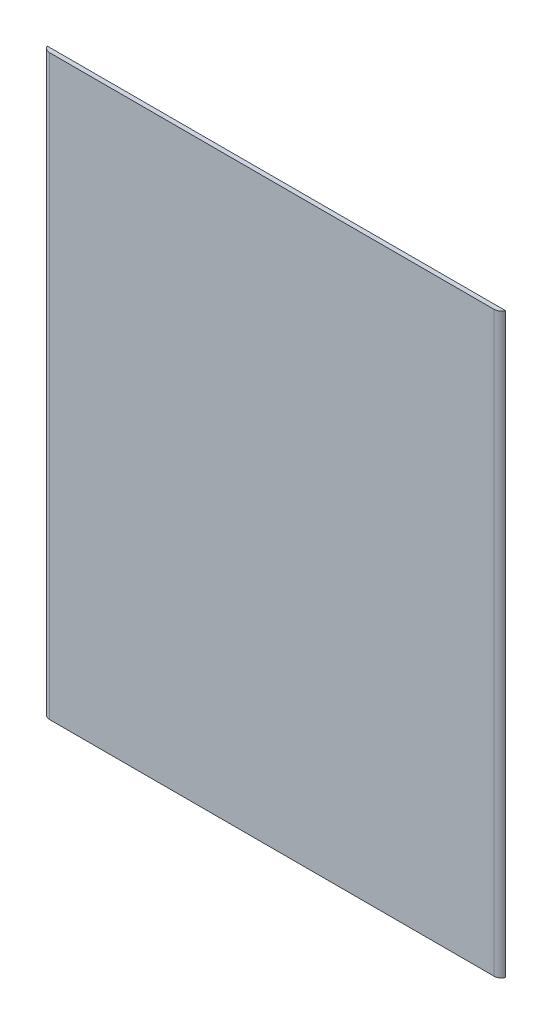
ISO-10303-21;
HEADER;
FILE_DESCRIPTION(('STEP AP214'),'2;1');
FILE_NAME('part.step','',(''),(''),'','','');
FILE_SCHEMA(('AUTOMOTIVE_DESIGN { 1 0 10303 214 1 1 1 1 }'));
ENDSEC;
DATA;
#1=APPLICATION_CONTEXT('core data for automotive mechanical design processes');
#2=APPLICATION_PROTOCOL_DEFINITION('international standard','automotive_design',2000,#1);
#3=PRODUCT_CONTEXT('',#1,'mechanical');
#4=PRODUCT('Part','Part','',(#3));
#5=PRODUCT_RELATED_PRODUCT_CATEGORY('part','',(#4));
#6=PRODUCT_DEFINITION_FORMATION('','',#4);
#7=PRODUCT_DEFINITION_CONTEXT('part definition',#1,'design');
#8=PRODUCT_DEFINITION('design','',#6,#7);
#9=PRODUCT_DEFINITION_SHAPE('','',#8);
#10=(LENGTH_UNIT() NAMED_UNIT(*) SI_UNIT(.MILLI.,.METRE.));
#11=(NAMED_UNIT(*) PLANE_ANGLE_UNIT() SI_UNIT($,.RADIAN.));
#12=(NAMED_UNIT(*) SI_UNIT($,.STERADIAN.) SOLID_ANGLE_UNIT());
#13=UNCERTAINTY_MEASURE_WITH_UNIT(LENGTH_MEASURE(1.E-05),#10,'distance_accuracy_value','');
#14=(GEOMETRIC_REPRESENTATION_CONTEXT(3) GLOBAL_UNCERTAINTY_ASSIGNED_CONTEXT((#13)) GLOBAL_UNIT_ASSIGNED_CONTEXT((#10,
#11,#12)) REPRESENTATION_CONTEXT('',''));
#15=CARTESIAN_POINT('',(0.,0.,0.));
#16=DIRECTION('',(0.,0.,1.));
#17=DIRECTION('',(1.,0.,0.));
#18=AXIS2_PLACEMENT_3D('',#15,#16,#17);
#19=CARTESIAN_POINT('',(0.,-750.,6.));
#20=DIRECTION('',(0.,1.,0.));
#21=DIRECTION('',(0.,0.,1.));
#22=AXIS2_PLACEMENT_3D('',#19,#20,#21);
#23=PLANE('',#22);
#24=DIRECTION('',(1.,0.,0.));
#25=VECTOR('',#24,1.);
#26=CARTESIAN_POINT('',(0.,-750.,6.));
#27=LINE('',#26,#25);
#28=CARTESIAN_POINT('',(9.16515138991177,-750.,6.));
#29=VERTEX_POINT('',#28);
#30=CARTESIAN_POINT('',(590.834848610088,-750.,6.));
#31=VERTEX_POINT('',#30);
#32=EDGE_CURVE('E68',#29,#31,#27,.T.);
#33=ORIENTED_EDGE('',*,*,#32,.F.);
#34=CARTESIAN_POINT('',(9.16515138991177,-750.,-4.));
#35=DIRECTION('',(0.,1.,0.));
#36=DIRECTION('',(0.,0.,1.));
#37=AXIS2_PLACEMENT_3D('',#34,#35,#36);
#38=CIRCLE('',#37,10.);
#39=CARTESIAN_POINT('',(0.,-750.,0.));
#40=VERTEX_POINT('',#39);
#41=EDGE_CURVE('E11',#29,#40,#38,.F.);
#42=ORIENTED_EDGE('',*,*,#41,.T.);
#43=DIRECTION('',(1.,0.,0.));
#44=VECTOR('',#43,1.);
#45=CARTESIAN_POINT('',(0.,-750.,0.));
#46=LINE('',#45,#44);
#47=CARTESIAN_POINT('',(600.,-750.,0.));
#48=VERTEX_POINT('',#47);
#49=EDGE_CURVE('E98',#40,#48,#46,.T.);
#50=ORIENTED_EDGE('',*,*,#49,.T.);
#51=CARTESIAN_POINT('',(590.834848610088,-750.,-4.));
#52=DIRECTION('',(0.,1.,0.));
#53=DIRECTION('',(0.,0.,1.));
#54=AXIS2_PLACEMENT_3D('',#51,#52,#53);
#55=CIRCLE('',#54,10.);
#56=EDGE_CURVE('E94',#48,#31,#55,.F.);
#57=ORIENTED_EDGE('',*,*,#56,.T.);
#58=EDGE_LOOP('',(#33,#42,#50,#57));
#59=FACE_BOUND('',#58,.T.);
#60=ADVANCED_FACE('F47',(#59),#23,.F.);
#61=CARTESIAN_POINT('',(0.,0.,6.));
#62=DIRECTION('',(0.,0.,1.));
#63=DIRECTION('',(1.,0.,0.));
#64=AXIS2_PLACEMENT_3D('',#61,#62,#63);
#65=PLANE('',#64);
#66=DIRECTION('',(0.,-1.,0.));
#67=VECTOR('',#66,1.);
#68=CARTESIAN_POINT('',(590.834848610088,0.,6.));
#69=LINE('',#68,#67);
#70=CARTESIAN_POINT('',(590.834848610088,6.,6.));
#71=VERTEX_POINT('',#70);
#72=EDGE_CURVE('E123',#31,#71,#69,.F.);
#73=ORIENTED_EDGE('',*,*,#72,.T.);
#74=DIRECTION('',(1.,0.,0.));
#75=VECTOR('',#74,1.);
#76=CARTESIAN_POINT('',(0.,6.,6.));
#77=LINE('',#76,#75);
#78=CARTESIAN_POINT('',(9.16515138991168,6.,6.));
#79=VERTEX_POINT('',#78);
#80=EDGE_CURVE('E113',#79,#71,#77,.T.);
#81=ORIENTED_EDGE('',*,*,#80,.F.);
#82=DIRECTION('',(0.,1.,0.));
#83=VECTOR('',#82,1.);
#84=CARTESIAN_POINT('',(9.16515138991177,-750.,6.));
#85=LINE('',#84,#83);
#86=EDGE_CURVE('E56',#79,#29,#85,.F.);
#87=ORIENTED_EDGE('',*,*,#86,.T.);
#88=ORIENTED_EDGE('',*,*,#32,.T.);
#89=EDGE_LOOP('',(#73,#81,#87,#88));
#90=FACE_BOUND('',#89,.T.);
#91=ADVANCED_FACE('F132',(#90),#65,.T.);
#92=CARTESIAN_POINT('',(0.,0.,0.));
#93=DIRECTION('',(0.,0.,1.));
#94=DIRECTION('',(1.,0.,0.));
#95=AXIS2_PLACEMENT_3D('',#92,#93,#94);
#96=PLANE('',#95);
#97=DIRECTION('',(0.,-1.,0.));
#98=VECTOR('',#97,1.);
#99=CARTESIAN_POINT('',(0.,0.,0.));
#100=LINE('',#99,#98);
#101=CARTESIAN_POINT('',(0.,6.,0.));
#102=VERTEX_POINT('',#101);
#103=EDGE_CURVE('E103',#102,#40,#100,.T.);
#104=ORIENTED_EDGE('',*,*,#103,.F.);
#105=DIRECTION('',(-1.,0.,0.));
#106=VECTOR('',#105,1.);
#107=CARTESIAN_POINT('',(0.,6.,0.));
#108=LINE('',#107,#106);
#109=CARTESIAN_POINT('',(600.,6.,0.));
#110=VERTEX_POINT('',#109);
#111=EDGE_CURVE('E101',#110,#102,#108,.T.);
#112=ORIENTED_EDGE('',*,*,#111,.F.);
#113=DIRECTION('',(0.,1.,0.));
#114=VECTOR('',#113,1.);
#115=CARTESIAN_POINT('',(600.,0.,0.));
#116=LINE('',#115,#114);
#117=EDGE_CURVE('E88',#48,#110,#116,.T.);
#118=ORIENTED_EDGE('',*,*,#117,.F.);
#119=ORIENTED_EDGE('',*,*,#49,.F.);
#120=EDGE_LOOP('',(#104,#112,#118,#119));
#121=FACE_BOUND('',#120,.T.);
#122=ADVANCED_FACE('F102',(#121),#96,.F.);
#123=CARTESIAN_POINT('',(590.834848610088,0.,-4.));
#124=DIRECTION('',(0.,1.,0.));
#125=DIRECTION('',(-1.,0.,0.));
#126=AXIS2_PLACEMENT_3D('',#123,#124,#125);
#127=CYLINDRICAL_SURFACE('',#126,10.);
#128=ORIENTED_EDGE('',*,*,#56,.F.);
#129=ORIENTED_EDGE('',*,*,#117,.T.);
#130=CARTESIAN_POINT('',(590.834848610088,6.,-4.));
#131=DIRECTION('',(0.,1.,0.));
#132=DIRECTION('',(0.,0.,1.));
#133=AXIS2_PLACEMENT_3D('',#130,#131,#132);
#134=CIRCLE('',#133,10.);
#135=EDGE_CURVE('E93',#71,#110,#134,.T.);
#136=ORIENTED_EDGE('',*,*,#135,.F.);
#137=ORIENTED_EDGE('',*,*,#72,.F.);
#138=EDGE_LOOP('',(#128,#129,#136,#137));
#139=FACE_BOUND('',#138,.T.);
#140=ADVANCED_FACE('F90',(#139),#127,.T.);
#141=CARTESIAN_POINT('',(9.16515138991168,0.,-4.));
#142=DIRECTION('',(0.,-1.,0.));
#143=DIRECTION('',(1.,0.,0.));
#144=AXIS2_PLACEMENT_3D('',#141,#142,#143);
#145=CYLINDRICAL_SURFACE('',#144,10.);
#146=ORIENTED_EDGE('',*,*,#86,.F.);
#147=CARTESIAN_POINT('',(9.16515138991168,6.,-4.));
#148=DIRECTION('',(0.,1.,0.));
#149=DIRECTION('',(0.,0.,1.));
#150=AXIS2_PLACEMENT_3D('',#147,#148,#149);
#151=CIRCLE('',#150,10.);
#152=EDGE_CURVE('E108',#102,#79,#151,.T.);
#153=ORIENTED_EDGE('',*,*,#152,.F.);
#154=ORIENTED_EDGE('',*,*,#103,.T.);
#155=ORIENTED_EDGE('',*,*,#41,.F.);
#156=EDGE_LOOP('',(#146,#153,#154,#155));
#157=FACE_BOUND('',#156,.T.);
#158=ADVANCED_FACE('F49',(#157),#145,.T.);
#159=CARTESIAN_POINT('',(0.,6.,0.));
#160=DIRECTION('',(0.,1.,0.));
#161=DIRECTION('',(0.,0.,1.));
#162=AXIS2_PLACEMENT_3D('',#159,#160,#161);
#163=PLANE('',#162);
#164=ORIENTED_EDGE('',*,*,#135,.T.);
#165=ORIENTED_EDGE('',*,*,#111,.T.);
#166=ORIENTED_EDGE('',*,*,#152,.T.);
#167=ORIENTED_EDGE('',*,*,#80,.T.);
#168=EDGE_LOOP('',(#164,#165,#166,#167));
#169=FACE_BOUND('',#168,.T.);
#170=ADVANCED_FACE('F111',(#169),#163,.T.);
#171=CLOSED_SHELL('',(#60,#91,#122,#140,#158,#170));
#172=MANIFOLD_SOLID_BREP('B2',#171);
#173=ADVANCED_BREP_SHAPE_REPRESENTATION('',(#18,#172),#14);
#174=SHAPE_DEFINITION_REPRESENTATION(#9,#173);
ENDSEC;
END-ISO-10303-21;
